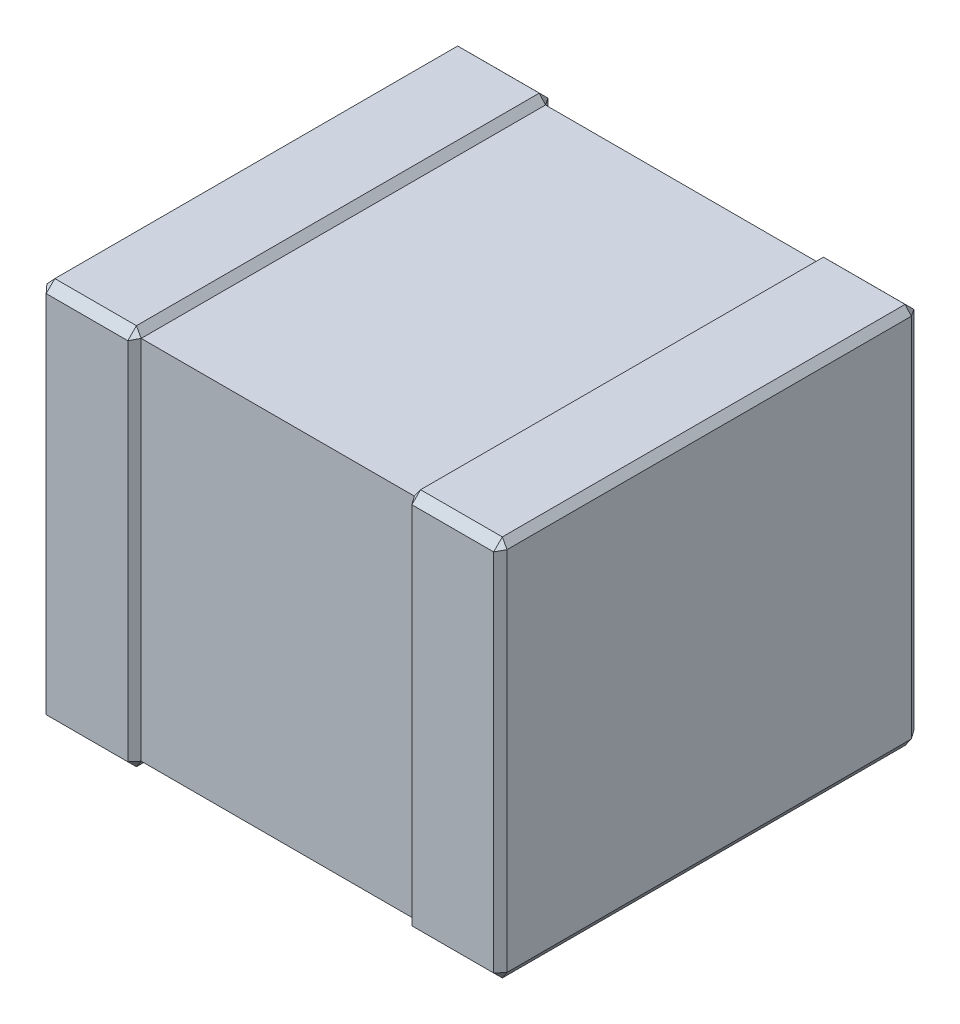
ISO-10303-21;
HEADER;
FILE_DESCRIPTION(('STEP AP214'),'2;1');
FILE_NAME('part.step','',(''),(''),'','','');
FILE_SCHEMA(('AUTOMOTIVE_DESIGN { 1 0 10303 214 1 1 1 1 }'));
ENDSEC;
DATA;
#1=APPLICATION_CONTEXT('core data for automotive mechanical design processes');
#2=APPLICATION_PROTOCOL_DEFINITION('international standard','automotive_design',2000,#1);
#3=PRODUCT_CONTEXT('',#1,'mechanical');
#4=PRODUCT('Part','Part','',(#3));
#5=PRODUCT_RELATED_PRODUCT_CATEGORY('part','',(#4));
#6=PRODUCT_DEFINITION_FORMATION('','',#4);
#7=PRODUCT_DEFINITION_CONTEXT('part definition',#1,'design');
#8=PRODUCT_DEFINITION('design','',#6,#7);
#9=PRODUCT_DEFINITION_SHAPE('','',#8);
#10=(LENGTH_UNIT() NAMED_UNIT(*) SI_UNIT(.MILLI.,.METRE.));
#11=(NAMED_UNIT(*) PLANE_ANGLE_UNIT() SI_UNIT($,.RADIAN.));
#12=(NAMED_UNIT(*) SI_UNIT($,.STERADIAN.) SOLID_ANGLE_UNIT());
#13=UNCERTAINTY_MEASURE_WITH_UNIT(LENGTH_MEASURE(1.E-05),#10,'distance_accuracy_value','');
#14=(GEOMETRIC_REPRESENTATION_CONTEXT(3) GLOBAL_UNCERTAINTY_ASSIGNED_CONTEXT((#13)) GLOBAL_UNIT_ASSIGNED_CONTEXT((#10,
#11,#12)) REPRESENTATION_CONTEXT('',''));
#15=CARTESIAN_POINT('',(0.,0.,0.));
#16=DIRECTION('',(0.,0.,1.));
#17=DIRECTION('',(1.,0.,0.));
#18=AXIS2_PLACEMENT_3D('',#15,#16,#17);
#19=CARTESIAN_POINT('',(1.530112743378,1.210036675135,2.786660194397));
#20=DIRECTION('',(-1.,0.,0.));
#21=DIRECTION('',(0.,0.,1.));
#22=AXIS2_PLACEMENT_3D('',#19,#20,#21);
#23=PLANE('',#22);
#24=CARTESIAN_POINT('',(1.53011274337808,1.23416797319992,0.0879480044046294));
#25=DIRECTION('',(0.,-1.,0.));
#26=VECTOR('',#25,1.);
#27=LINE('',#24,#26);
#28=CARTESIAN_POINT('',(1.53011274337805,1.22210232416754,0.100069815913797));
#29=VERTEX_POINT('',#28);
#30=CARTESIAN_POINT('',(1.53011274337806,-1.22210232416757,0.100069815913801));
#31=VERTEX_POINT('',#30);
#32=EDGE_CURVE('E204',#29,#31,#27,.T.);
#33=ORIENTED_EDGE('',*,*,#32,.F.);
#34=CARTESIAN_POINT('',(1.5301127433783,1.23416797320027,2.81090386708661));
#35=DIRECTION('',(0.,0.,-1.));
#36=VECTOR('',#35,1.);
#37=LINE('',#34,#36);
#38=CARTESIAN_POINT('',(1.530112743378,1.2221023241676,2.79878203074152));
#39=VERTEX_POINT('',#38);
#40=EDGE_CURVE('E212',#39,#29,#37,.T.);
#41=ORIENTED_EDGE('',*,*,#40,.F.);
#42=CARTESIAN_POINT('',(1.53011274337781,-1.2341679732,2.81090386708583));
#43=DIRECTION('',(0.,1.,0.));
#44=VECTOR('',#43,1.);
#45=LINE('',#42,#44);
#46=CARTESIAN_POINT('',(1.530112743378,-1.22210232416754,2.79878203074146));
#47=VERTEX_POINT('',#46);
#48=EDGE_CURVE('E217',#47,#39,#45,.T.);
#49=ORIENTED_EDGE('',*,*,#48,.F.);
#50=CARTESIAN_POINT('',(1.5301127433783,-1.23416797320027,0.0879480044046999));
#51=DIRECTION('',(0.,0.,1.));
#52=VECTOR('',#51,1.);
#53=LINE('',#50,#52);
#54=EDGE_CURVE('E182',#31,#47,#53,.T.);
#55=ORIENTED_EDGE('',*,*,#54,.F.);
#56=EDGE_LOOP('',(#33,#41,#49,#55));
#57=FACE_BOUND('',#56,.T.);
#58=ADVANCED_FACE('F17',(#57),#23,.F.);
#59=CARTESIAN_POINT('',(1.502857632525,-1.264651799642,1.467872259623));
#60=DIRECTION('',(-0.745482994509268,0.66652464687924,0.));
#61=DIRECTION('',(-0.66652464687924,-0.745482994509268,0.));
#62=AXIS2_PLACEMENT_3D('',#59,#60,#61);
#63=PLANE('',#62);
#64=DIRECTION('',(0.,0.,1.));
#65=VECTOR('',#64,1.);
#66=CARTESIAN_POINT('',(1.493605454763,-1.275000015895,0.104939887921));
#67=LINE('',#66,#65);
#68=CARTESIAN_POINT('',(1.49360545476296,-1.27500001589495,2.79391193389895));
#69=VERTEX_POINT('',#68);
#70=CARTESIAN_POINT('',(1.49360545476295,-1.27500001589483,0.104939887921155));
#71=VERTEX_POINT('',#70);
#72=EDGE_CURVE('E186',#69,#71,#67,.F.);
#73=ORIENTED_EDGE('',*,*,#72,.T.);
#74=DIRECTION('',(0.636595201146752,0.712008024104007,-0.296295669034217));
#75=VECTOR('',#74,1.);
#76=CARTESIAN_POINT('',(1.49360545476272,-1.27500001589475,0.104939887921));
#77=LINE('',#76,#75);
#78=EDGE_CURVE('E177',#71,#31,#77,.T.);
#79=ORIENTED_EDGE('',*,*,#78,.T.);
#80=ORIENTED_EDGE('',*,*,#54,.T.);
#81=DIRECTION('',(-0.636595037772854,-0.712007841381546,-0.296296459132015));
#82=VECTOR('',#81,1.);
#83=CARTESIAN_POINT('',(1.530112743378,-1.2341679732,2.810903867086));
#84=LINE('',#83,#82);
#85=EDGE_CURVE('E211',#47,#69,#84,.T.);
#86=ORIENTED_EDGE('',*,*,#85,.T.);
#87=EDGE_LOOP('',(#73,#79,#80,#86));
#88=FACE_BOUND('',#87,.T.);
#89=ADVANCED_FACE('F179',(#88),#63,.F.);
#90=CARTESIAN_POINT('',(1.5028707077,0.01843952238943,2.841514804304));
#91=DIRECTION('',(0.747017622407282,0.,0.664804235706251));
#92=DIRECTION('',(0.664804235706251,0.,-0.747017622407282));
#93=AXIS2_PLACEMENT_3D('',#90,#91,#92);
#94=PLANE('',#93);
#95=DIRECTION('',(0.,1.,0.));
#96=VECTOR('',#95,1.);
#97=CARTESIAN_POINT('',(1.493605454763,1.217254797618,2.851925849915));
#98=LINE('',#97,#96);
#99=CARTESIAN_POINT('',(1.49360545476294,1.21725479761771,2.85192584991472));
#100=VERTEX_POINT('',#99);
#101=CARTESIAN_POINT('',(1.49360545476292,-1.21725479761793,2.85192584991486));
#102=VERTEX_POINT('',#101);
#103=EDGE_CURVE('E560',#100,#102,#98,.F.);
#104=ORIENTED_EDGE('',*,*,#103,.T.);
#105=DIRECTION('',(0.635352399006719,-0.29434743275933,-0.713923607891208));
#106=VECTOR('',#105,1.);
#107=CARTESIAN_POINT('',(1.49360545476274,-1.217254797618,2.85192584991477));
#108=LINE('',#107,#106);
#109=EDGE_CURVE('E218',#102,#47,#108,.T.);
#110=ORIENTED_EDGE('',*,*,#109,.T.);
#111=ORIENTED_EDGE('',*,*,#48,.T.);
#112=DIRECTION('',(-0.635352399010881,-0.294347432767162,0.713923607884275));
#113=VECTOR('',#112,1.);
#114=CARTESIAN_POINT('',(1.530112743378,1.2341679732,2.810903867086));
#115=LINE('',#114,#113);
#116=EDGE_CURVE('E543',#39,#100,#115,.T.);
#117=ORIENTED_EDGE('',*,*,#116,.T.);
#118=EDGE_LOOP('',(#104,#110,#111,#117));
#119=FACE_BOUND('',#118,.T.);
#120=ADVANCED_FACE('F239',(#119),#94,.T.);
#121=CARTESIAN_POINT('',(1.530112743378,-1.2341679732,2.810903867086));
#122=DIRECTION('',(-0.421163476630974,0.64282198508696,-0.63984468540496));
#123=DIRECTION('',(0.,0.705463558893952,0.708746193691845));
#124=AXIS2_PLACEMENT_3D('',#121,#122,#123);
#125=PLANE('',#124);
#126=DIRECTION('',(0.,-0.705463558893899,-0.708746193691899));
#127=VECTOR('',#126,1.);
#128=CARTESIAN_POINT('',(1.493605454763,-1.232767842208,2.836340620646));
#129=LINE('',#128,#127);
#130=EDGE_CURVE('E569',#69,#102,#129,.F.);
#131=ORIENTED_EDGE('',*,*,#130,.F.);
#132=ORIENTED_EDGE('',*,*,#85,.F.);
#133=ORIENTED_EDGE('',*,*,#109,.F.);
#134=EDGE_LOOP('',(#131,#132,#133));
#135=FACE_BOUND('',#134,.T.);
#136=ADVANCED_FACE('F243',(#135),#125,.F.);
#137=CARTESIAN_POINT('',(1.504261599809,1.242628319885,0.07943174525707));
#138=DIRECTION('',(0.421164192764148,0.642821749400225,-0.639844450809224));
#139=DIRECTION('',(0.,0.705463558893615,0.708746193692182));
#140=AXIS2_PLACEMENT_3D('',#137,#138,#139);
#141=PLANE('',#140);
#142=DIRECTION('',(0.,-0.705463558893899,-0.708746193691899));
#143=VECTOR('',#142,1.);
#144=CARTESIAN_POINT('',(1.493605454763,1.275000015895,0.104939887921));
#145=LINE('',#144,#143);
#146=CARTESIAN_POINT('',(1.49360545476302,1.21725479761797,0.0469259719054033));
#147=VERTEX_POINT('',#146);
#148=CARTESIAN_POINT('',(1.49360545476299,1.27500001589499,0.104939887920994));
#149=VERTEX_POINT('',#148);
#150=EDGE_CURVE('E574',#147,#149,#145,.F.);
#151=ORIENTED_EDGE('',*,*,#150,.T.);
#152=DIRECTION('',(0.636595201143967,-0.712008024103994,-0.29629566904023));
#153=VECTOR('',#152,1.);
#154=CARTESIAN_POINT('',(1.49360545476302,1.27500001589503,0.104939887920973));
#155=LINE('',#154,#153);
#156=EDGE_CURVE('E538',#149,#29,#155,.T.);
#157=ORIENTED_EDGE('',*,*,#156,.T.);
#158=DIRECTION('',(0.635352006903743,0.294347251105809,0.713924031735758));
#159=VECTOR('',#158,1.);
#160=CARTESIAN_POINT('',(1.49360545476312,1.217254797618,0.0469259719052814));
#161=LINE('',#160,#159);
#162=EDGE_CURVE('E199',#147,#29,#161,.T.);
#163=ORIENTED_EDGE('',*,*,#162,.F.);
#164=EDGE_LOOP('',(#151,#157,#163));
#165=FACE_BOUND('',#164,.T.);
#166=ADVANCED_FACE('F270',(#165),#141,.T.);
#167=CARTESIAN_POINT('',(1.502857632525,1.264651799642,1.467872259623));
#168=DIRECTION('',(0.745482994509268,0.66652464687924,0.));
#169=DIRECTION('',(-0.66652464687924,0.745482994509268,0.));
#170=AXIS2_PLACEMENT_3D('',#167,#168,#169);
#171=PLANE('',#170);
#172=DIRECTION('',(0.,0.,-1.));
#173=VECTOR('',#172,1.);
#174=CARTESIAN_POINT('',(1.493605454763,1.275000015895,0.104939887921));
#175=LINE('',#174,#173);
#176=CARTESIAN_POINT('',(1.49360545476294,1.27500001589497,2.79391193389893));
#177=VERTEX_POINT('',#176);
#178=EDGE_CURVE('E581',#149,#177,#175,.F.);
#179=ORIENTED_EDGE('',*,*,#178,.T.);
#180=DIRECTION('',(0.636595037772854,-0.712007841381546,0.296296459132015));
#181=VECTOR('',#180,1.);
#182=CARTESIAN_POINT('',(1.49360545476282,1.27500001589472,2.79391193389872));
#183=LINE('',#182,#181);
#184=EDGE_CURVE('E200',#177,#39,#183,.T.);
#185=ORIENTED_EDGE('',*,*,#184,.T.);
#186=ORIENTED_EDGE('',*,*,#40,.T.);
#187=ORIENTED_EDGE('',*,*,#156,.F.);
#188=EDGE_LOOP('',(#179,#185,#186,#187));
#189=FACE_BOUND('',#188,.T.);
#190=ADVANCED_FACE('F260',(#189),#171,.T.);
#191=CARTESIAN_POINT('',(1.530112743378,1.2341679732,2.810903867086));
#192=DIRECTION('',(-0.421163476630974,-0.64282198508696,-0.63984468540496));
#193=DIRECTION('',(0.,0.705463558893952,-0.708746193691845));
#194=AXIS2_PLACEMENT_3D('',#191,#192,#193);
#195=PLANE('',#194);
#196=DIRECTION('',(0.,0.705463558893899,-0.708746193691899));
#197=VECTOR('',#196,1.);
#198=CARTESIAN_POINT('',(1.493605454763,1.275000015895,2.793911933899));
#199=LINE('',#198,#197);
#200=EDGE_CURVE('E584',#177,#100,#199,.F.);
#201=ORIENTED_EDGE('',*,*,#200,.T.);
#202=ORIENTED_EDGE('',*,*,#116,.F.);
#203=ORIENTED_EDGE('',*,*,#184,.F.);
#204=EDGE_LOOP('',(#201,#202,#203));
#205=FACE_BOUND('',#204,.T.);
#206=ADVANCED_FACE('F269',(#205),#195,.F.);
#207=CARTESIAN_POINT('',(1.504261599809,-1.242628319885,0.07943174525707));
#208=DIRECTION('',(0.421164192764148,-0.642821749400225,-0.639844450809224));
#209=DIRECTION('',(0.,0.705463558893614,-0.708746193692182));
#210=AXIS2_PLACEMENT_3D('',#207,#208,#209);
#211=PLANE('',#210);
#212=DIRECTION('',(0.,0.705463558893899,-0.708746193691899));
#213=VECTOR('',#212,1.);
#214=CARTESIAN_POINT('',(1.493605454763,-1.232767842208,0.06251120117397));
#215=LINE('',#214,#213);
#216=CARTESIAN_POINT('',(1.49360545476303,-1.21725479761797,0.0469259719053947));
#217=VERTEX_POINT('',#216);
#218=EDGE_CURVE('E195',#217,#71,#215,.F.);
#219=ORIENTED_EDGE('',*,*,#218,.F.);
#220=DIRECTION('',(0.635352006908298,-0.294347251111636,0.713924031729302));
#221=VECTOR('',#220,1.);
#222=CARTESIAN_POINT('',(1.49360545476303,-1.21725479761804,0.0469259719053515));
#223=LINE('',#222,#221);
#224=EDGE_CURVE('E192',#217,#31,#223,.T.);
#225=ORIENTED_EDGE('',*,*,#224,.T.);
#226=ORIENTED_EDGE('',*,*,#78,.F.);
#227=EDGE_LOOP('',(#219,#225,#226));
#228=FACE_BOUND('',#227,.T.);
#229=ADVANCED_FACE('F194',(#228),#211,.T.);
#230=CARTESIAN_POINT('',(1.502870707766,0.01843953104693,0.05733703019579));
#231=DIRECTION('',(0.747018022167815,0.,-0.664803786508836));
#232=DIRECTION('',(-0.664803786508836,0.,-0.747018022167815));
#233=AXIS2_PLACEMENT_3D('',#230,#231,#232);
#234=PLANE('',#233);
#235=DIRECTION('',(0.,1.,0.));
#236=VECTOR('',#235,1.);
#237=CARTESIAN_POINT('',(1.493605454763,-1.217254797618,0.04692597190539));
#238=LINE('',#237,#236);
#239=EDGE_CURVE('E603',#217,#147,#238,.T.);
#240=ORIENTED_EDGE('',*,*,#239,.T.);
#241=ORIENTED_EDGE('',*,*,#162,.T.);
#242=ORIENTED_EDGE('',*,*,#32,.T.);
#243=ORIENTED_EDGE('',*,*,#224,.F.);
#244=EDGE_LOOP('',(#240,#241,#242,#243));
#245=FACE_BOUND('',#244,.T.);
#246=ADVANCED_FACE('F206',(#245),#234,.T.);
#247=CARTESIAN_POINT('',(1.201830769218,1.232767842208,2.836340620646));
#248=DIRECTION('',(0.,-0.708746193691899,-0.705463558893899));
#249=DIRECTION('',(0.,0.705463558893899,-0.708746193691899));
#250=AXIS2_PLACEMENT_3D('',#247,#248,#249);
#251=PLANE('',#250);
#252=DIRECTION('',(1.,0.,0.));
#253=VECTOR('',#252,1.);
#254=CARTESIAN_POINT('',(1.201830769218,1.21725479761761,2.85192584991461));
#255=LINE('',#254,#253);
#256=CARTESIAN_POINT('',(0.94793065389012,1.2172547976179,2.85192584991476));
#257=VERTEX_POINT('',#256);
#258=EDGE_CURVE('E593',#100,#257,#255,.F.);
#259=ORIENTED_EDGE('',*,*,#258,.F.);
#260=ORIENTED_EDGE('',*,*,#200,.F.);
#261=DIRECTION('',(1.,0.,0.));
#262=VECTOR('',#261,1.);
#263=CARTESIAN_POINT('',(0.94793065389,1.275000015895,2.793911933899));
#264=LINE('',#263,#262);
#265=CARTESIAN_POINT('',(0.947930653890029,1.27500001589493,2.79391193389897));
#266=VERTEX_POINT('',#265);
#267=EDGE_CURVE('E613',#177,#266,#264,.F.);
#268=ORIENTED_EDGE('',*,*,#267,.T.);
#269=DIRECTION('',(0.,0.705463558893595,-0.708746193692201));
#270=VECTOR('',#269,1.);
#271=CARTESIAN_POINT('',(0.947930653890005,1.24613537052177,2.82291089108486));
#272=LINE('',#271,#270);
#273=EDGE_CURVE('E618',#266,#257,#272,.F.);
#274=ORIENTED_EDGE('',*,*,#273,.T.);
#275=EDGE_LOOP('',(#259,#260,#268,#274));
#276=FACE_BOUND('',#275,.T.);
#277=ADVANCED_FACE('F754',(#276),#251,.F.);
#278=CARTESIAN_POINT('',(1.493605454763,-1.275000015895,0.104939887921));
#279=DIRECTION('',(0.,1.,0.));
#280=DIRECTION('',(0.,0.,1.));
#281=AXIS2_PLACEMENT_3D('',#278,#279,#280);
#282=PLANE('',#281);
#283=DIRECTION('',(0.,0.,1.));
#284=VECTOR('',#283,1.);
#285=CARTESIAN_POINT('',(0.947930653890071,-1.27500001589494,1.467872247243));
#286=LINE('',#285,#284);
#287=CARTESIAN_POINT('',(0.947930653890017,-1.27500001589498,2.793911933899));
#288=VERTEX_POINT('',#287);
#289=CARTESIAN_POINT('',(0.947930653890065,-1.27500001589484,0.104939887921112));
#290=VERTEX_POINT('',#289);
#291=EDGE_CURVE('E632',#288,#290,#286,.F.);
#292=ORIENTED_EDGE('',*,*,#291,.T.);
#293=DIRECTION('',(1.,0.,0.));
#294=VECTOR('',#293,1.);
#295=CARTESIAN_POINT('',(1.201830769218,-1.27500001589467,0.10493988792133));
#296=LINE('',#295,#294);
#297=EDGE_CURVE('E623',#71,#290,#296,.F.);
#298=ORIENTED_EDGE('',*,*,#297,.F.);
#299=ORIENTED_EDGE('',*,*,#72,.F.);
#300=DIRECTION('',(1.,0.,0.));
#301=VECTOR('',#300,1.);
#302=CARTESIAN_POINT('',(1.493605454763,-1.275000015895,2.793911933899));
#303=LINE('',#302,#301);
#304=EDGE_CURVE('E556',#288,#69,#303,.T.);
#305=ORIENTED_EDGE('',*,*,#304,.F.);
#306=EDGE_LOOP('',(#292,#298,#299,#305));
#307=FACE_BOUND('',#306,.T.);
#308=ADVANCED_FACE('F750',(#307),#282,.F.);
#309=CARTESIAN_POINT('',(0.94793065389,1.217254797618,2.851925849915));
#310=DIRECTION('',(0.,0.,-1.));
#311=DIRECTION('',(-1.,0.,0.));
#312=AXIS2_PLACEMENT_3D('',#309,#310,#311);
#313=PLANE('',#312);
#314=DIRECTION('',(-1.,0.,0.));
#315=VECTOR('',#314,1.);
#316=CARTESIAN_POINT('',(0.94793065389,-1.217254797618,2.851925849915));
#317=LINE('',#316,#315);
#318=CARTESIAN_POINT('',(0.947930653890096,-1.21725479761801,2.85192584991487));
#319=VERTEX_POINT('',#318);
#320=EDGE_CURVE('E605',#102,#319,#317,.T.);
#321=ORIENTED_EDGE('',*,*,#320,.F.);
#322=ORIENTED_EDGE('',*,*,#103,.F.);
#323=ORIENTED_EDGE('',*,*,#258,.T.);
#324=DIRECTION('',(0.,1.,0.));
#325=VECTOR('',#324,1.);
#326=CARTESIAN_POINT('',(0.947930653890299,0.01843951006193,2.85192584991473));
#327=LINE('',#326,#325);
#328=EDGE_CURVE('E637',#319,#257,#327,.T.);
#329=ORIENTED_EDGE('',*,*,#328,.F.);
#330=EDGE_LOOP('',(#321,#322,#323,#329));
#331=FACE_BOUND('',#330,.T.);
#332=ADVANCED_FACE('F746',(#331),#313,.F.);
#333=CARTESIAN_POINT('',(0.94793065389,-1.217254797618,2.851925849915));
#334=DIRECTION('',(0.,0.708746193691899,-0.705463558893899));
#335=DIRECTION('',(0.,0.705463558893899,0.708746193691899));
#336=AXIS2_PLACEMENT_3D('',#333,#334,#335);
#337=PLANE('',#336);
#338=ORIENTED_EDGE('',*,*,#304,.T.);
#339=ORIENTED_EDGE('',*,*,#130,.T.);
#340=ORIENTED_EDGE('',*,*,#320,.T.);
#341=DIRECTION('',(0.,-0.705463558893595,-0.708746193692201));
#342=VECTOR('',#341,1.);
#343=CARTESIAN_POINT('',(0.947930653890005,-1.24613537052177,2.82291089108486));
#344=LINE('',#343,#342);
#345=EDGE_CURVE('E649',#288,#319,#344,.F.);
#346=ORIENTED_EDGE('',*,*,#345,.F.);
#347=EDGE_LOOP('',(#338,#339,#340,#346));
#348=FACE_BOUND('',#347,.T.);
#349=ADVANCED_FACE('F742',(#348),#337,.F.);
#350=CARTESIAN_POINT('',(1.201830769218,1.232767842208,0.06251120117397));
#351=DIRECTION('',(0.,0.708746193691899,-0.705463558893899));
#352=DIRECTION('',(0.,0.705463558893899,0.708746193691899));
#353=AXIS2_PLACEMENT_3D('',#350,#351,#352);
#354=PLANE('',#353);
#355=DIRECTION('',(1.,0.,0.));
#356=VECTOR('',#355,1.);
#357=CARTESIAN_POINT('',(0.94793065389,1.217254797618,0.04692597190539));
#358=LINE('',#357,#356);
#359=CARTESIAN_POINT('',(0.947930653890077,1.2172547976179,0.0469259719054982));
#360=VERTEX_POINT('',#359);
#361=EDGE_CURVE('E627',#147,#360,#358,.F.);
#362=ORIENTED_EDGE('',*,*,#361,.T.);
#363=DIRECTION('',(0.,-0.705463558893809,-0.708746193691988));
#364=VECTOR('',#363,1.);
#365=CARTESIAN_POINT('',(0.947930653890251,1.24618292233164,0.0759887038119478));
#366=LINE('',#365,#364);
#367=CARTESIAN_POINT('',(0.947930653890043,1.27500001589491,0.104939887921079));
#368=VERTEX_POINT('',#367);
#369=EDGE_CURVE('E652',#360,#368,#366,.F.);
#370=ORIENTED_EDGE('',*,*,#369,.T.);
#371=DIRECTION('',(1.,0.,0.));
#372=VECTOR('',#371,1.);
#373=CARTESIAN_POINT('',(0.94793065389,1.275000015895,0.104939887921));
#374=LINE('',#373,#372);
#375=EDGE_CURVE('E578',#368,#149,#374,.T.);
#376=ORIENTED_EDGE('',*,*,#375,.T.);
#377=ORIENTED_EDGE('',*,*,#150,.F.);
#378=EDGE_LOOP('',(#362,#370,#376,#377));
#379=FACE_BOUND('',#378,.T.);
#380=ADVANCED_FACE('F738',(#379),#354,.T.);
#381=CARTESIAN_POINT('',(0.94793065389,1.275000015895,0.104939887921));
#382=DIRECTION('',(0.,-1.,0.));
#383=DIRECTION('',(0.,0.,-1.));
#384=AXIS2_PLACEMENT_3D('',#381,#382,#383);
#385=PLANE('',#384);
#386=ORIENTED_EDGE('',*,*,#267,.F.);
#387=ORIENTED_EDGE('',*,*,#178,.F.);
#388=ORIENTED_EDGE('',*,*,#375,.F.);
#389=DIRECTION('',(0.,0.,1.));
#390=VECTOR('',#389,1.);
#391=CARTESIAN_POINT('',(0.947930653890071,1.27500001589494,1.467872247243));
#392=LINE('',#391,#390);
#393=EDGE_CURVE('E661',#368,#266,#392,.T.);
#394=ORIENTED_EDGE('',*,*,#393,.T.);
#395=EDGE_LOOP('',(#386,#387,#388,#394));
#396=FACE_BOUND('',#395,.T.);
#397=ADVANCED_FACE('F734',(#396),#385,.F.);
#398=CARTESIAN_POINT('',(0.937274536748,1.242628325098,2.819420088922));
#399=DIRECTION('',(0.421164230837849,-0.642821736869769,-0.63984443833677));
#400=DIRECTION('',(0.,0.705463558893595,-0.708746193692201));
#401=AXIS2_PLACEMENT_3D('',#398,#399,#400);
#402=PLANE('',#401);
#403=ORIENTED_EDGE('',*,*,#273,.F.);
#404=DIRECTION('',(-0.636594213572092,-0.712008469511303,0.296296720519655));
#405=VECTOR('',#404,1.);
#406=CARTESIAN_POINT('',(0.947930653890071,1.27500001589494,2.793911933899));
#407=LINE('',#406,#405);
#408=CARTESIAN_POINT('',(0.911423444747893,1.22210232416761,2.79878203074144));
#409=VERTEX_POINT('',#408);
#410=EDGE_CURVE('E666',#266,#409,#407,.T.);
#411=ORIENTED_EDGE('',*,*,#410,.T.);
#412=DIRECTION('',(-0.635351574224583,0.294347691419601,-0.713924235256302));
#413=VECTOR('',#412,1.);
#414=CARTESIAN_POINT('',(0.947930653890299,1.217254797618,2.85192584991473));
#415=LINE('',#414,#413);
#416=EDGE_CURVE('E642',#257,#409,#415,.T.);
#417=ORIENTED_EDGE('',*,*,#416,.F.);
#418=EDGE_LOOP('',(#403,#411,#417));
#419=FACE_BOUND('',#418,.T.);
#420=ADVANCED_FACE('F730',(#419),#402,.F.);
#421=CARTESIAN_POINT('',(1.201830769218,-1.259486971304,0.08935465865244));
#422=DIRECTION('',(0.,-0.708746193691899,-0.705463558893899));
#423=DIRECTION('',(0.,0.705463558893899,-0.708746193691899));
#424=AXIS2_PLACEMENT_3D('',#421,#422,#423);
#425=PLANE('',#424);
#426=ORIENTED_EDGE('',*,*,#297,.T.);
#427=DIRECTION('',(0.,-0.705463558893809,0.708746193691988));
#428=VECTOR('',#427,1.);
#429=CARTESIAN_POINT('',(0.947930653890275,-1.24613537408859,0.0759409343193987));
#430=LINE('',#429,#428);
#431=CARTESIAN_POINT('',(0.947930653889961,-1.21725479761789,0.0469259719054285));
#432=VERTEX_POINT('',#431);
#433=EDGE_CURVE('E671',#290,#432,#430,.F.);
#434=ORIENTED_EDGE('',*,*,#433,.T.);
#435=DIRECTION('',(1.,0.,0.));
#436=VECTOR('',#435,1.);
#437=CARTESIAN_POINT('',(0.94793065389,-1.217254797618,0.04692597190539));
#438=LINE('',#437,#436);
#439=EDGE_CURVE('E600',#432,#217,#438,.T.);
#440=ORIENTED_EDGE('',*,*,#439,.T.);
#441=ORIENTED_EDGE('',*,*,#218,.T.);
#442=EDGE_LOOP('',(#426,#434,#440,#441));
#443=FACE_BOUND('',#442,.T.);
#444=ADVANCED_FACE('F726',(#443),#425,.T.);
#445=CARTESIAN_POINT('',(0.94793065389,-1.217254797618,0.04692597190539));
#446=DIRECTION('',(0.,0.,1.));
#447=DIRECTION('',(1.,0.,0.));
#448=AXIS2_PLACEMENT_3D('',#445,#446,#447);
#449=PLANE('',#448);
#450=ORIENTED_EDGE('',*,*,#361,.F.);
#451=ORIENTED_EDGE('',*,*,#239,.F.);
#452=ORIENTED_EDGE('',*,*,#439,.F.);
#453=DIRECTION('',(0.,1.,0.));
#454=VECTOR('',#453,1.);
#455=CARTESIAN_POINT('',(0.947930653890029,1.2341679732,0.0469259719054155));
#456=LINE('',#455,#454);
#457=EDGE_CURVE('E676',#432,#360,#456,.T.);
#458=ORIENTED_EDGE('',*,*,#457,.T.);
#459=EDGE_LOOP('',(#450,#451,#452,#458));
#460=FACE_BOUND('',#459,.T.);
#461=ADVANCED_FACE('F722',(#460),#449,.F.);
#462=CARTESIAN_POINT('',(0.937274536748,-1.242628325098,2.819420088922));
#463=DIRECTION('',(-0.421164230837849,-0.642821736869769,0.63984443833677));
#464=DIRECTION('',(0.,-0.705463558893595,-0.708746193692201));
#465=AXIS2_PLACEMENT_3D('',#462,#463,#464);
#466=PLANE('',#465);
#467=ORIENTED_EDGE('',*,*,#345,.T.);
#468=DIRECTION('',(-0.635351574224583,-0.294347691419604,-0.7139242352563));
#469=VECTOR('',#468,1.);
#470=CARTESIAN_POINT('',(0.947930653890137,-1.217254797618,2.85192584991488));
#471=LINE('',#470,#469);
#472=CARTESIAN_POINT('',(0.911423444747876,-1.22210232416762,2.79878203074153));
#473=VERTEX_POINT('',#472);
#474=EDGE_CURVE('E691',#319,#473,#471,.T.);
#475=ORIENTED_EDGE('',*,*,#474,.T.);
#476=DIRECTION('',(0.636594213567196,-0.712008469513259,-0.296296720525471));
#477=VECTOR('',#476,1.);
#478=CARTESIAN_POINT('',(0.911423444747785,-1.23416797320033,2.81090386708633));
#479=LINE('',#478,#477);
#480=EDGE_CURVE('E646',#473,#288,#479,.T.);
#481=ORIENTED_EDGE('',*,*,#480,.T.);
#482=EDGE_LOOP('',(#467,#475,#481));
#483=FACE_BOUND('',#482,.T.);
#484=ADVANCED_FACE('F718',(#483),#466,.T.);
#485=CARTESIAN_POINT('',(0.911423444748,1.2341679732,0.0879480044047));
#486=DIRECTION('',(0.42116494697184,-0.642821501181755,0.639844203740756));
#487=DIRECTION('',(0.,-0.705463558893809,-0.708746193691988));
#488=AXIS2_PLACEMENT_3D('',#485,#486,#487);
#489=PLANE('',#488);
#490=ORIENTED_EDGE('',*,*,#369,.F.);
#491=DIRECTION('',(-0.63535118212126,0.294347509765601,0.713924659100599));
#492=VECTOR('',#491,1.);
#493=CARTESIAN_POINT('',(0.947930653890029,1.217254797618,0.0469259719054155));
#494=LINE('',#493,#492);
#495=CARTESIAN_POINT('',(0.911423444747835,1.22210232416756,0.100069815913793));
#496=VERTEX_POINT('',#495);
#497=EDGE_CURVE('E681',#360,#496,#494,.T.);
#498=ORIENTED_EDGE('',*,*,#497,.T.);
#499=DIRECTION('',(0.636594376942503,0.712008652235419,0.296295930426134));
#500=VECTOR('',#499,1.);
#501=CARTESIAN_POINT('',(0.91142344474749,1.23416797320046,0.0879480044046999));
#502=LINE('',#501,#500);
#503=EDGE_CURVE('E784',#496,#368,#502,.T.);
#504=ORIENTED_EDGE('',*,*,#503,.T.);
#505=EDGE_LOOP('',(#490,#498,#504));
#506=FACE_BOUND('',#505,.T.);
#507=ADVANCED_FACE('F714',(#506),#489,.F.);
#508=CARTESIAN_POINT('',(0.937274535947,-1.242628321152,0.07943174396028));
#509=DIRECTION('',(0.42116494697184,0.642821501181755,0.639844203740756));
#510=DIRECTION('',(0.,-0.705463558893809,0.708746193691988));
#511=AXIS2_PLACEMENT_3D('',#508,#509,#510);
#512=PLANE('',#511);
#513=ORIENTED_EDGE('',*,*,#433,.F.);
#514=DIRECTION('',(-0.636594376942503,0.712008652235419,-0.296295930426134));
#515=VECTOR('',#514,1.);
#516=CARTESIAN_POINT('',(0.94793065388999,-1.27500001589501,0.104939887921));
#517=LINE('',#516,#515);
#518=CARTESIAN_POINT('',(0.911423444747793,-1.22210232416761,0.100069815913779));
#519=VERTEX_POINT('',#518);
#520=EDGE_CURVE('E686',#290,#519,#517,.T.);
#521=ORIENTED_EDGE('',*,*,#520,.T.);
#522=DIRECTION('',(0.63535118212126,0.294347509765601,-0.713924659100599));
#523=VECTOR('',#522,1.);
#524=CARTESIAN_POINT('',(0.911423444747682,-1.2341679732,0.0879480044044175));
#525=LINE('',#524,#523);
#526=EDGE_CURVE('E787',#519,#432,#525,.T.);
#527=ORIENTED_EDGE('',*,*,#526,.T.);
#528=EDGE_LOOP('',(#513,#521,#527));
#529=FACE_BOUND('',#528,.T.);
#530=ADVANCED_FACE('F709',(#529),#512,.F.);
#531=CARTESIAN_POINT('',(0.920618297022,-1.244452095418,1.439475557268));
#532=DIRECTION('',(0.745483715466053,0.666523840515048,0.));
#533=DIRECTION('',(-0.666523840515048,0.745483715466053,0.));
#534=AXIS2_PLACEMENT_3D('',#531,#532,#533);
#535=PLANE('',#534);
#536=ORIENTED_EDGE('',*,*,#520,.F.);
#537=ORIENTED_EDGE('',*,*,#291,.F.);
#538=ORIENTED_EDGE('',*,*,#480,.F.);
#539=CARTESIAN_POINT('',(0.91142344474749,-1.23416797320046,2.810903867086));
#540=DIRECTION('',(0.,0.,-1.));
#541=VECTOR('',#540,1.);
#542=LINE('',#539,#541);
#543=EDGE_CURVE('E828',#473,#519,#542,.T.);
#544=ORIENTED_EDGE('',*,*,#543,.T.);
#545=EDGE_LOOP('',(#536,#537,#538,#544));
#546=FACE_BOUND('',#545,.T.);
#547=ADVANCED_FACE('F698',(#546),#535,.F.);
#548=CARTESIAN_POINT('',(0.911423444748,1.2341679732,2.810903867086));
#549=DIRECTION('',(0.747018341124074,0.,-0.664803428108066));
#550=DIRECTION('',(-0.664803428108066,0.,-0.747018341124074));
#551=AXIS2_PLACEMENT_3D('',#548,#549,#550);
#552=PLANE('',#551);
#553=ORIENTED_EDGE('',*,*,#474,.F.);
#554=ORIENTED_EDGE('',*,*,#328,.T.);
#555=ORIENTED_EDGE('',*,*,#416,.T.);
#556=CARTESIAN_POINT('',(0.911423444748,1.2341679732,2.810903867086));
#557=DIRECTION('',(0.,-1.,0.));
#558=VECTOR('',#557,1.);
#559=LINE('',#556,#558);
#560=EDGE_CURVE('E437',#409,#473,#559,.T.);
#561=ORIENTED_EDGE('',*,*,#560,.T.);
#562=EDGE_LOOP('',(#553,#554,#555,#561));
#563=FACE_BOUND('',#562,.T.);
#564=ADVANCED_FACE('F708',(#563),#552,.F.);
#565=CARTESIAN_POINT('',(0.920618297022,1.244452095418,1.439475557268));
#566=DIRECTION('',(0.745483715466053,-0.666523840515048,0.));
#567=DIRECTION('',(0.666523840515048,0.745483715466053,0.));
#568=AXIS2_PLACEMENT_3D('',#565,#566,#567);
#569=PLANE('',#568);
#570=ORIENTED_EDGE('',*,*,#503,.F.);
#571=CARTESIAN_POINT('',(0.911423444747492,1.23416797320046,0.0879480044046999));
#572=DIRECTION('',(0.,0.,1.));
#573=VECTOR('',#572,1.);
#574=LINE('',#571,#573);
#575=EDGE_CURVE('E451',#496,#409,#574,.T.);
#576=ORIENTED_EDGE('',*,*,#575,.T.);
#577=ORIENTED_EDGE('',*,*,#410,.F.);
#578=ORIENTED_EDGE('',*,*,#393,.F.);
#579=EDGE_LOOP('',(#570,#576,#577,#578));
#580=FACE_BOUND('',#579,.T.);
#581=ADVANCED_FACE('F805',(#580),#569,.F.);
#582=CARTESIAN_POINT('',(0.92062571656,-0.009982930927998,0.07760769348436));
#583=DIRECTION('',(0.747018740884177,0.,0.664802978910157));
#584=DIRECTION('',(0.664802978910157,0.,-0.747018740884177));
#585=AXIS2_PLACEMENT_3D('',#582,#583,#584);
#586=PLANE('',#585);
#587=ORIENTED_EDGE('',*,*,#526,.F.);
#588=CARTESIAN_POINT('',(0.911423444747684,-1.2341679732,0.0879480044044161));
#589=DIRECTION('',(0.,1.,0.));
#590=VECTOR('',#589,1.);
#591=LINE('',#588,#590);
#592=EDGE_CURVE('E400',#519,#496,#591,.T.);
#593=ORIENTED_EDGE('',*,*,#592,.T.);
#594=ORIENTED_EDGE('',*,*,#497,.F.);
#595=ORIENTED_EDGE('',*,*,#457,.F.);
#596=EDGE_LOOP('',(#587,#593,#594,#595));
#597=FACE_BOUND('',#596,.T.);
#598=ADVANCED_FACE('F463',(#597),#586,.F.);
#599=CARTESIAN_POINT('',(0.911423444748,1.210036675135,2.786660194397));
#600=DIRECTION('',(0.,-1.,0.));
#601=DIRECTION('',(0.,0.,-1.));
#602=AXIS2_PLACEMENT_3D('',#599,#600,#601);
#603=PLANE('',#602);
#604=CARTESIAN_POINT('',(-0.89057191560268,1.210036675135,0.100069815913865));
#605=DIRECTION('',(0.,0.,1.));
#606=VECTOR('',#605,1.);
#607=LINE('',#604,#606);
#608=CARTESIAN_POINT('',(-0.912147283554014,1.2221023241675,0.100069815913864));
#609=VERTEX_POINT('',#608);
#610=CARTESIAN_POINT('',(-0.912147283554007,1.22210232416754,2.79878203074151));
#611=VERTEX_POINT('',#610);
#612=EDGE_CURVE('E477',#609,#611,#607,.T.);
#613=ORIENTED_EDGE('',*,*,#612,.T.);
#614=DIRECTION('',(-1.,0.,0.));
#615=VECTOR('',#614,1.);
#616=CARTESIAN_POINT('',(0.911423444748,1.210036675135,2.786660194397));
#617=LINE('',#616,#615);
#618=EDGE_CURVE('E846',#611,#409,#617,.F.);
#619=ORIENTED_EDGE('',*,*,#618,.T.);
#620=ORIENTED_EDGE('',*,*,#575,.F.);
#621=DIRECTION('',(1.,0.,0.));
#622=VECTOR('',#621,1.);
#623=CARTESIAN_POINT('',(0.911423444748,1.210036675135,0.112191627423));
#624=LINE('',#623,#622);
#625=EDGE_CURVE('E852',#496,#609,#624,.F.);
#626=ORIENTED_EDGE('',*,*,#625,.T.);
#627=EDGE_LOOP('',(#613,#619,#620,#626));
#628=FACE_BOUND('',#627,.T.);
#629=ADVANCED_FACE('F454',(#628),#603,.F.);
#630=CARTESIAN_POINT('',(0.911423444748,1.210036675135,2.786660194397));
#631=DIRECTION('',(0.,0.,-1.));
#632=DIRECTION('',(-1.,0.,0.));
#633=AXIS2_PLACEMENT_3D('',#630,#631,#632);
#634=PLANE('',#633);
#635=DIRECTION('',(0.,-1.,0.));
#636=VECTOR('',#635,1.);
#637=CARTESIAN_POINT('',(-0.890571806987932,-0.00998292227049,2.786660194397));
#638=LINE('',#637,#636);
#639=CARTESIAN_POINT('',(-0.912147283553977,-1.22210232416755,2.79878203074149));
#640=VERTEX_POINT('',#639);
#641=EDGE_CURVE('E481',#611,#640,#638,.T.);
#642=ORIENTED_EDGE('',*,*,#641,.T.);
#643=DIRECTION('',(1.,0.,0.));
#644=VECTOR('',#643,1.);
#645=CARTESIAN_POINT('',(0.911423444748,-1.210036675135,2.786660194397));
#646=LINE('',#645,#644);
#647=EDGE_CURVE('E848',#640,#473,#646,.T.);
#648=ORIENTED_EDGE('',*,*,#647,.T.);
#649=ORIENTED_EDGE('',*,*,#560,.F.);
#650=ORIENTED_EDGE('',*,*,#618,.F.);
#651=EDGE_LOOP('',(#642,#648,#649,#650));
#652=FACE_BOUND('',#651,.T.);
#653=ADVANCED_FACE('F420',(#652),#634,.F.);
#654=CARTESIAN_POINT('',(0.911423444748,-1.210036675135,2.786660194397));
#655=DIRECTION('',(0.,1.,0.));
#656=DIRECTION('',(0.,0.,1.));
#657=AXIS2_PLACEMENT_3D('',#654,#655,#656);
#658=PLANE('',#657);
#659=DIRECTION('',(0.,0.,-1.));
#660=VECTOR('',#659,1.);
#661=CARTESIAN_POINT('',(-0.890571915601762,-1.210036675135,1.439475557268));
#662=LINE('',#661,#660);
#663=CARTESIAN_POINT('',(-0.912147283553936,-1.22210232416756,0.10006981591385));
#664=VERTEX_POINT('',#663);
#665=EDGE_CURVE('E484',#640,#664,#662,.T.);
#666=ORIENTED_EDGE('',*,*,#665,.T.);
#667=DIRECTION('',(1.,0.,0.));
#668=VECTOR('',#667,1.);
#669=CARTESIAN_POINT('',(0.911423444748,-1.210036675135,0.112191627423));
#670=LINE('',#669,#668);
#671=EDGE_CURVE('E842',#664,#519,#670,.T.);
#672=ORIENTED_EDGE('',*,*,#671,.T.);
#673=ORIENTED_EDGE('',*,*,#543,.F.);
#674=ORIENTED_EDGE('',*,*,#647,.F.);
#675=EDGE_LOOP('',(#666,#672,#673,#674));
#676=FACE_BOUND('',#675,.T.);
#677=ADVANCED_FACE('F416',(#676),#658,.F.);
#678=CARTESIAN_POINT('',(0.911423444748,1.210036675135,0.112191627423));
#679=DIRECTION('',(0.,0.,1.));
#680=DIRECTION('',(1.,0.,0.));
#681=AXIS2_PLACEMENT_3D('',#678,#679,#680);
#682=PLANE('',#681);
#683=DIRECTION('',(0.,1.,0.));
#684=VECTOR('',#683,1.);
#685=CARTESIAN_POINT('',(-0.890571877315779,1.2341679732,0.112191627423));
#686=LINE('',#685,#684);
#687=EDGE_CURVE('E492',#664,#609,#686,.T.);
#688=ORIENTED_EDGE('',*,*,#687,.T.);
#689=ORIENTED_EDGE('',*,*,#625,.F.);
#690=ORIENTED_EDGE('',*,*,#592,.F.);
#691=ORIENTED_EDGE('',*,*,#671,.F.);
#692=EDGE_LOOP('',(#688,#689,#690,#691));
#693=FACE_BOUND('',#692,.T.);
#694=ADVANCED_FACE('F407',(#693),#682,.F.);
#695=CARTESIAN_POINT('',(-0.937998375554,-1.242628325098,2.819420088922));
#696=DIRECTION('',(-0.421164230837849,0.642821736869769,-0.63984443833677));
#697=DIRECTION('',(0.,0.705463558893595,0.708746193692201));
#698=AXIS2_PLACEMENT_3D('',#695,#696,#697);
#699=PLANE('',#698);
#700=DIRECTION('',(0.,0.705463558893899,0.708746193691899));
#701=VECTOR('',#700,1.);
#702=CARTESIAN_POINT('',(-0.948654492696,-1.275000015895,2.793911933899));
#703=LINE('',#702,#701);
#704=CARTESIAN_POINT('',(-0.94865449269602,-1.21725479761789,2.85192584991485));
#705=VERTEX_POINT('',#704);
#706=CARTESIAN_POINT('',(-0.948654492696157,-1.27500001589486,2.793911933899));
#707=VERTEX_POINT('',#706);
#708=EDGE_CURVE('E882',#705,#707,#703,.F.);
#709=ORIENTED_EDGE('',*,*,#708,.T.);
#710=DIRECTION('',(0.636594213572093,0.712008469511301,0.296296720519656));
#711=VECTOR('',#710,1.);
#712=CARTESIAN_POINT('',(-0.948654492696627,-1.27500001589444,2.793911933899));
#713=LINE('',#712,#711);
#714=EDGE_CURVE('E887',#707,#640,#713,.T.);
#715=ORIENTED_EDGE('',*,*,#714,.T.);
#716=DIRECTION('',(0.635351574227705,-0.294347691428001,-0.71392423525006));
#717=VECTOR('',#716,1.);
#718=CARTESIAN_POINT('',(-0.948654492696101,-1.21725479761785,2.85192584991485));
#719=LINE('',#718,#717);
#720=EDGE_CURVE('E489',#705,#640,#719,.T.);
#721=ORIENTED_EDGE('',*,*,#720,.F.);
#722=EDGE_LOOP('',(#709,#715,#721));
#723=FACE_BOUND('',#722,.T.);
#724=ADVANCED_FACE('F380',(#723),#699,.F.);
#725=CARTESIAN_POINT('',(-0.939402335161,1.264651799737,1.467872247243));
#726=DIRECTION('',(-0.745483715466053,-0.666523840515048,0.));
#727=DIRECTION('',(0.666523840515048,-0.745483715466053,0.));
#728=AXIS2_PLACEMENT_3D('',#725,#726,#727);
#729=PLANE('',#728);
#730=DIRECTION('',(0.,0.,-1.));
#731=VECTOR('',#730,1.);
#732=CARTESIAN_POINT('',(-0.948654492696,1.275000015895,2.793911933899));
#733=LINE('',#732,#731);
#734=CARTESIAN_POINT('',(-0.948654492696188,1.27500001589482,0.104939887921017));
#735=VERTEX_POINT('',#734);
#736=CARTESIAN_POINT('',(-0.948654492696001,1.27500001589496,2.79391193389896));
#737=VERTEX_POINT('',#736);
#738=EDGE_CURVE('E899',#735,#737,#733,.F.);
#739=ORIENTED_EDGE('',*,*,#738,.T.);
#740=DIRECTION('',(-0.636594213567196,0.712008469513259,-0.296296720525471));
#741=VECTOR('',#740,1.);
#742=CARTESIAN_POINT('',(-0.912147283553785,1.23416797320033,2.81090386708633));
#743=LINE('',#742,#741);
#744=EDGE_CURVE('E495',#611,#737,#743,.T.);
#745=ORIENTED_EDGE('',*,*,#744,.F.);
#746=ORIENTED_EDGE('',*,*,#612,.F.);
#747=DIRECTION('',(0.636594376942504,-0.712008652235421,-0.296295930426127));
#748=VECTOR('',#747,1.);
#749=CARTESIAN_POINT('',(-0.9486544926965,1.27500001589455,0.104939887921));
#750=LINE('',#749,#748);
#751=EDGE_CURVE('E856',#735,#609,#750,.T.);
#752=ORIENTED_EDGE('',*,*,#751,.F.);
#753=EDGE_LOOP('',(#739,#745,#746,#752));
#754=FACE_BOUND('',#753,.T.);
#755=ADVANCED_FACE('F375',(#754),#729,.F.);
#756=CARTESIAN_POINT('',(-0.937998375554,1.242628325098,2.819420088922));
#757=DIRECTION('',(0.421164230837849,0.642821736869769,0.63984443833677));
#758=DIRECTION('',(0.,-0.705463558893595,0.708746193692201));
#759=AXIS2_PLACEMENT_3D('',#756,#757,#758);
#760=PLANE('',#759);
#761=DIRECTION('',(0.,0.705463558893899,-0.708746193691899));
#762=VECTOR('',#761,1.);
#763=CARTESIAN_POINT('',(-0.948654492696,1.232769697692,2.836338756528));
#764=LINE('',#763,#762);
#765=CARTESIAN_POINT('',(-0.948654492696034,1.21725479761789,2.85192584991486));
#766=VERTEX_POINT('',#765);
#767=EDGE_CURVE('E902',#737,#766,#764,.F.);
#768=ORIENTED_EDGE('',*,*,#767,.T.);
#769=DIRECTION('',(0.635351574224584,0.2943476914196,-0.713924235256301));
#770=VECTOR('',#769,1.);
#771=CARTESIAN_POINT('',(-0.948654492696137,1.217254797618,2.85192584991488));
#772=LINE('',#771,#770);
#773=EDGE_CURVE('E868',#766,#611,#772,.T.);
#774=ORIENTED_EDGE('',*,*,#773,.T.);
#775=ORIENTED_EDGE('',*,*,#744,.T.);
#776=EDGE_LOOP('',(#768,#774,#775));
#777=FACE_BOUND('',#776,.T.);
#778=ADVANCED_FACE('F371',(#777),#760,.T.);
#779=CARTESIAN_POINT('',(-0.912147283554,1.2341679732,2.810903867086));
#780=DIRECTION('',(-0.747018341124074,0.,-0.664803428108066));
#781=DIRECTION('',(-0.664803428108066,0.,0.747018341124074));
#782=AXIS2_PLACEMENT_3D('',#779,#780,#781);
#783=PLANE('',#782);
#784=DIRECTION('',(0.,1.,0.));
#785=VECTOR('',#784,1.);
#786=CARTESIAN_POINT('',(-0.948654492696,1.217254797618,2.851925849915));
#787=LINE('',#786,#785);
#788=EDGE_CURVE('E914',#766,#705,#787,.F.);
#789=ORIENTED_EDGE('',*,*,#788,.T.);
#790=ORIENTED_EDGE('',*,*,#720,.T.);
#791=ORIENTED_EDGE('',*,*,#641,.F.);
#792=ORIENTED_EDGE('',*,*,#773,.F.);
#793=EDGE_LOOP('',(#789,#790,#791,#792));
#794=FACE_BOUND('',#793,.T.);
#795=ADVANCED_FACE('F367',(#794),#783,.F.);
#796=CARTESIAN_POINT('',(-0.912147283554,-1.2341679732,0.0879480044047));
#797=DIRECTION('',(-0.42116494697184,0.642821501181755,0.639844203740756));
#798=DIRECTION('',(0.,-0.705463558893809,0.708746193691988));
#799=AXIS2_PLACEMENT_3D('',#796,#797,#798);
#800=PLANE('',#799);
#801=DIRECTION('',(0.,-0.705463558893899,0.708746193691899));
#802=VECTOR('',#801,1.);
#803=CARTESIAN_POINT('',(-0.948654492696,-1.217254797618,0.04692597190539));
#804=LINE('',#803,#802);
#805=CARTESIAN_POINT('',(-0.948654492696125,-1.27500001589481,0.10493988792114));
#806=VERTEX_POINT('',#805);
#807=CARTESIAN_POINT('',(-0.948654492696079,-1.21725479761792,0.0469259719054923));
#808=VERTEX_POINT('',#807);
#809=EDGE_CURVE('E917',#806,#808,#804,.F.);
#810=ORIENTED_EDGE('',*,*,#809,.T.);
#811=DIRECTION('',(-0.63535118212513,0.294347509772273,-0.713924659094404));
#812=VECTOR('',#811,1.);
#813=CARTESIAN_POINT('',(-0.912147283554,-1.2341679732,0.0879480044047));
#814=LINE('',#813,#812);
#815=EDGE_CURVE('E873',#664,#808,#814,.T.);
#816=ORIENTED_EDGE('',*,*,#815,.F.);
#817=DIRECTION('',(0.636594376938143,0.712008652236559,-0.296295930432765));
#818=VECTOR('',#817,1.);
#819=CARTESIAN_POINT('',(-0.94865449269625,-1.27500001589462,0.10493988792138));
#820=LINE('',#819,#818);
#821=EDGE_CURVE('E877',#806,#664,#820,.T.);
#822=ORIENTED_EDGE('',*,*,#821,.F.);
#823=EDGE_LOOP('',(#810,#816,#822));
#824=FACE_BOUND('',#823,.T.);
#825=ADVANCED_FACE('F363',(#824),#800,.F.);
#826=CARTESIAN_POINT('',(-0.939402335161,-1.264651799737,1.467872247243));
#827=DIRECTION('',(-0.745483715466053,0.666523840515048,0.));
#828=DIRECTION('',(-0.666523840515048,-0.745483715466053,0.));
#829=AXIS2_PLACEMENT_3D('',#826,#827,#828);
#830=PLANE('',#829);
#831=DIRECTION('',(0.,0.,1.));
#832=VECTOR('',#831,1.);
#833=CARTESIAN_POINT('',(-0.948654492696,-1.275000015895,2.793911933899));
#834=LINE('',#833,#832);
#835=EDGE_CURVE('E929',#707,#806,#834,.F.);
#836=ORIENTED_EDGE('',*,*,#835,.T.);
#837=ORIENTED_EDGE('',*,*,#821,.T.);
#838=ORIENTED_EDGE('',*,*,#665,.F.);
#839=ORIENTED_EDGE('',*,*,#714,.F.);
#840=EDGE_LOOP('',(#836,#837,#838,#839));
#841=FACE_BOUND('',#840,.T.);
#842=ADVANCED_FACE('F359',(#841),#830,.F.);
#843=CARTESIAN_POINT('',(-0.939389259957,0.01843951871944,0.05733703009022));
#844=DIRECTION('',(-0.747018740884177,0.,0.664802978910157));
#845=DIRECTION('',(0.664802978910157,0.,0.747018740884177));
#846=AXIS2_PLACEMENT_3D('',#843,#844,#845);
#847=PLANE('',#846);
#848=DIRECTION('',(0.,1.,0.));
#849=VECTOR('',#848,1.);
#850=CARTESIAN_POINT('',(-0.948654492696,-1.217254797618,0.04692597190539));
#851=LINE('',#850,#849);
#852=CARTESIAN_POINT('',(-0.948654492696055,1.21725479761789,0.0469259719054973));
#853=VERTEX_POINT('',#852);
#854=EDGE_CURVE('E939',#808,#853,#851,.T.);
#855=ORIENTED_EDGE('',*,*,#854,.T.);
#856=DIRECTION('',(-0.635351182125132,-0.29434750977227,-0.713924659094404));
#857=VECTOR('',#856,1.);
#858=CARTESIAN_POINT('',(-0.912147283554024,1.23416797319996,0.0879480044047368));
#859=LINE('',#858,#857);
#860=EDGE_CURVE('E892',#609,#853,#859,.T.);
#861=ORIENTED_EDGE('',*,*,#860,.F.);
#862=ORIENTED_EDGE('',*,*,#687,.F.);
#863=ORIENTED_EDGE('',*,*,#815,.T.);
#864=EDGE_LOOP('',(#855,#861,#862,#863));
#865=FACE_BOUND('',#864,.T.);
#866=ADVANCED_FACE('F355',(#865),#847,.F.);
#867=CARTESIAN_POINT('',(-0.937998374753,1.242628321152,0.07943174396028));
#868=DIRECTION('',(0.42116494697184,0.642821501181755,-0.639844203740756));
#869=DIRECTION('',(0.,0.705463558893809,0.708746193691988));
#870=AXIS2_PLACEMENT_3D('',#867,#868,#869);
#871=PLANE('',#870);
#872=DIRECTION('',(0.,0.705463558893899,0.708746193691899));
#873=VECTOR('',#872,1.);
#874=CARTESIAN_POINT('',(-0.948654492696,1.232769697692,0.06251306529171));
#875=LINE('',#874,#873);
#876=EDGE_CURVE('E942',#735,#853,#875,.F.);
#877=ORIENTED_EDGE('',*,*,#876,.F.);
#878=ORIENTED_EDGE('',*,*,#751,.T.);
#879=ORIENTED_EDGE('',*,*,#860,.T.);
#880=EDGE_LOOP('',(#877,#878,#879));
#881=FACE_BOUND('',#880,.T.);
#882=ADVANCED_FACE('F351',(#881),#871,.T.);
#883=CARTESIAN_POINT('',(-1.23995193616,-1.232769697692,2.836338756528));
#884=DIRECTION('',(0.,0.708746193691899,-0.705463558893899));
#885=DIRECTION('',(0.,0.705463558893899,0.708746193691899));
#886=AXIS2_PLACEMENT_3D('',#883,#884,#885);
#887=PLANE('',#886);
#888=DIRECTION('',(-1.,0.,0.));
#889=VECTOR('',#888,1.);
#890=CARTESIAN_POINT('',(-1.493380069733,-1.217254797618,2.851925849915));
#891=LINE('',#890,#889);
#892=CARTESIAN_POINT('',(-1.49338006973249,-1.21725479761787,2.85192584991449));
#893=VERTEX_POINT('',#892);
#894=EDGE_CURVE('E956',#705,#893,#891,.T.);
#895=ORIENTED_EDGE('',*,*,#894,.T.);
#896=DIRECTION('',(0.,0.705463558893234,0.708746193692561));
#897=VECTOR('',#896,1.);
#898=CARTESIAN_POINT('',(-1.49338006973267,-1.24613537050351,2.82291089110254));
#899=LINE('',#898,#897);
#900=CARTESIAN_POINT('',(-1.49338006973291,-1.27500001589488,2.79391193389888));
#901=VERTEX_POINT('',#900);
#902=EDGE_CURVE('E961',#893,#901,#899,.F.);
#903=ORIENTED_EDGE('',*,*,#902,.T.);
#904=DIRECTION('',(1.,0.,0.));
#905=VECTOR('',#904,1.);
#906=CARTESIAN_POINT('',(-1.493380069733,-1.275000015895,2.793911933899));
#907=LINE('',#906,#905);
#908=EDGE_CURVE('E926',#901,#707,#907,.T.);
#909=ORIENTED_EDGE('',*,*,#908,.T.);
#910=ORIENTED_EDGE('',*,*,#708,.F.);
#911=EDGE_LOOP('',(#895,#903,#909,#910));
#912=FACE_BOUND('',#911,.T.);
#913=ADVANCED_FACE('F347',(#912),#887,.F.);
#914=CARTESIAN_POINT('',(-0.948654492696,1.275000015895,2.793911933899));
#915=DIRECTION('',(0.,-1.,0.));
#916=DIRECTION('',(0.,0.,-1.));
#917=AXIS2_PLACEMENT_3D('',#914,#915,#916);
#918=PLANE('',#917);
#919=DIRECTION('',(0.,0.,1.));
#920=VECTOR('',#919,1.);
#921=CARTESIAN_POINT('',(-1.4933800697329,1.27500001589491,1.467872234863));
#922=LINE('',#921,#920);
#923=CARTESIAN_POINT('',(-1.49338006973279,1.27500001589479,2.79391193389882));
#924=VERTEX_POINT('',#923);
#925=CARTESIAN_POINT('',(-1.4933800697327,1.2750000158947,0.104939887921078));
#926=VERTEX_POINT('',#925);
#927=EDGE_CURVE('E975',#924,#926,#922,.F.);
#928=ORIENTED_EDGE('',*,*,#927,.F.);
#929=DIRECTION('',(1.,0.,0.));
#930=VECTOR('',#929,1.);
#931=CARTESIAN_POINT('',(-0.948654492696,1.275000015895,2.793911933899));
#932=LINE('',#931,#930);
#933=EDGE_CURVE('E951',#924,#737,#932,.T.);
#934=ORIENTED_EDGE('',*,*,#933,.T.);
#935=ORIENTED_EDGE('',*,*,#738,.F.);
#936=DIRECTION('',(1.,0.,0.));
#937=VECTOR('',#936,1.);
#938=CARTESIAN_POINT('',(-0.948654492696,1.275000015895,0.104939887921));
#939=LINE('',#938,#937);
#940=EDGE_CURVE('E896',#926,#735,#939,.T.);
#941=ORIENTED_EDGE('',*,*,#940,.F.);
#942=EDGE_LOOP('',(#928,#934,#935,#941));
#943=FACE_BOUND('',#942,.T.);
#944=ADVANCED_FACE('F343',(#943),#918,.F.);
#945=CARTESIAN_POINT('',(-0.948654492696,1.275000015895,2.793911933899));
#946=DIRECTION('',(0.,-0.708746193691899,-0.705463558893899));
#947=DIRECTION('',(0.,0.705463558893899,-0.708746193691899));
#948=AXIS2_PLACEMENT_3D('',#945,#946,#947);
#949=PLANE('',#948);
#950=DIRECTION('',(0.,0.705463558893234,-0.708746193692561));
#951=VECTOR('',#950,1.);
#952=CARTESIAN_POINT('',(-1.49338006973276,1.2461828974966,2.82286314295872));
#953=LINE('',#952,#951);
#954=CARTESIAN_POINT('',(-1.49338006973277,1.21725479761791,2.85192584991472));
#955=VERTEX_POINT('',#954);
#956=EDGE_CURVE('E982',#924,#955,#953,.F.);
#957=ORIENTED_EDGE('',*,*,#956,.T.);
#958=DIRECTION('',(-1.,0.,0.));
#959=VECTOR('',#958,1.);
#960=CARTESIAN_POINT('',(-1.493380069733,1.217254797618,2.851925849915));
#961=LINE('',#960,#959);
#962=EDGE_CURVE('E911',#955,#766,#961,.F.);
#963=ORIENTED_EDGE('',*,*,#962,.T.);
#964=ORIENTED_EDGE('',*,*,#767,.F.);
#965=ORIENTED_EDGE('',*,*,#933,.F.);
#966=EDGE_LOOP('',(#957,#963,#964,#965));
#967=FACE_BOUND('',#966,.T.);
#968=ADVANCED_FACE('F339',(#967),#949,.F.);
#969=CARTESIAN_POINT('',(-1.493380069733,1.217254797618,2.851925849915));
#970=DIRECTION('',(0.,0.,-1.));
#971=DIRECTION('',(-1.,0.,0.));
#972=AXIS2_PLACEMENT_3D('',#969,#970,#971);
#973=PLANE('',#972);
#974=ORIENTED_EDGE('',*,*,#894,.F.);
#975=ORIENTED_EDGE('',*,*,#788,.F.);
#976=ORIENTED_EDGE('',*,*,#962,.F.);
#977=DIRECTION('',(0.,1.,0.));
#978=VECTOR('',#977,1.);
#979=CARTESIAN_POINT('',(-1.49338006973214,-0.01843949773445,2.85192584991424));
#980=LINE('',#979,#978);
#981=EDGE_CURVE('E985',#955,#893,#980,.F.);
#982=ORIENTED_EDGE('',*,*,#981,.T.);
#983=EDGE_LOOP('',(#974,#975,#976,#982));
#984=FACE_BOUND('',#983,.T.);
#985=ADVANCED_FACE('F335',(#984),#973,.F.);
#986=CARTESIAN_POINT('',(-1.23995193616,-1.25948511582,0.08935279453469));
#987=DIRECTION('',(0.,0.708746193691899,0.705463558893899));
#988=DIRECTION('',(0.,-0.705463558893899,0.708746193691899));
#989=AXIS2_PLACEMENT_3D('',#986,#987,#988);
#990=PLANE('',#989);
#991=DIRECTION('',(1.,0.,0.));
#992=VECTOR('',#991,1.);
#993=CARTESIAN_POINT('',(-1.493380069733,-1.275000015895,0.104939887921));
#994=LINE('',#993,#992);
#995=CARTESIAN_POINT('',(-1.49338006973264,-1.27500001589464,0.104939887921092));
#996=VERTEX_POINT('',#995);
#997=EDGE_CURVE('E966',#806,#996,#994,.F.);
#998=ORIENTED_EDGE('',*,*,#997,.T.);
#999=DIRECTION('',(0.,-0.705463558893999,0.708746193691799));
#1000=VECTOR('',#999,1.);
#1001=CARTESIAN_POINT('',(-1.4933800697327,-1.24613537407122,0.0759409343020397));
#1002=LINE('',#1001,#1000);
#1003=CARTESIAN_POINT('',(-1.49338006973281,-1.21725479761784,0.0469259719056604));
#1004=VERTEX_POINT('',#1003);
#1005=EDGE_CURVE('E999',#996,#1004,#1002,.F.);
#1006=ORIENTED_EDGE('',*,*,#1005,.T.);
#1007=DIRECTION('',(1.,0.,0.));
#1008=VECTOR('',#1007,1.);
#1009=CARTESIAN_POINT('',(-1.493380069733,-1.217254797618,0.04692597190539));
#1010=LINE('',#1009,#1008);
#1011=EDGE_CURVE('E932',#1004,#808,#1010,.T.);
#1012=ORIENTED_EDGE('',*,*,#1011,.T.);
#1013=ORIENTED_EDGE('',*,*,#809,.F.);
#1014=EDGE_LOOP('',(#998,#1006,#1012,#1013));
#1015=FACE_BOUND('',#1014,.T.);
#1016=ADVANCED_FACE('F331',(#1015),#990,.F.);
#1017=CARTESIAN_POINT('',(-1.504036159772,-1.242628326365,2.819420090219));
#1018=DIRECTION('',(0.421164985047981,0.642821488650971,-0.639844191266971));
#1019=DIRECTION('',(0.,0.705463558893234,0.708746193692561));
#1020=AXIS2_PLACEMENT_3D('',#1017,#1018,#1019);
#1021=PLANE('',#1020);
#1022=ORIENTED_EDGE('',*,*,#902,.F.);
#1023=DIRECTION('',(-0.635350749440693,-0.294347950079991,-0.71392486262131));
#1024=VECTOR('',#1023,1.);
#1025=CARTESIAN_POINT('',(-1.49338006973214,-1.217254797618,2.85192584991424));
#1026=LINE('',#1025,#1024);
#1027=CARTESIAN_POINT('',(-1.52988719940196,-1.22210232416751,2.79878203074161));
#1028=VERTEX_POINT('',#1027);
#1029=EDGE_CURVE('E994',#893,#1028,#1026,.T.);
#1030=ORIENTED_EDGE('',*,*,#1029,.T.);
#1031=DIRECTION('',(0.63659338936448,-0.712009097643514,-0.296296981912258));
#1032=VECTOR('',#1031,1.);
#1033=CARTESIAN_POINT('',(-1.52988719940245,-1.2341679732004,2.810903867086));
#1034=LINE('',#1033,#1032);
#1035=EDGE_CURVE('E1004',#1028,#901,#1034,.T.);
#1036=ORIENTED_EDGE('',*,*,#1035,.T.);
#1037=EDGE_LOOP('',(#1022,#1030,#1036));
#1038=FACE_BOUND('',#1037,.T.);
#1039=ADVANCED_FACE('F327',(#1038),#1021,.F.);
#1040=CARTESIAN_POINT('',(-1.493380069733,-1.275000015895,2.793911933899));
#1041=DIRECTION('',(0.,1.,0.));
#1042=DIRECTION('',(0.,0.,1.));
#1043=AXIS2_PLACEMENT_3D('',#1040,#1041,#1042);
#1044=PLANE('',#1043);
#1045=ORIENTED_EDGE('',*,*,#997,.F.);
#1046=ORIENTED_EDGE('',*,*,#835,.F.);
#1047=ORIENTED_EDGE('',*,*,#908,.F.);
#1048=DIRECTION('',(0.,0.,1.));
#1049=VECTOR('',#1048,1.);
#1050=CARTESIAN_POINT('',(-1.4933800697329,-1.27500001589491,1.467872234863));
#1051=LINE('',#1050,#1049);
#1052=EDGE_CURVE('E1007',#901,#996,#1051,.F.);
#1053=ORIENTED_EDGE('',*,*,#1052,.T.);
#1054=EDGE_LOOP('',(#1045,#1046,#1047,#1053));
#1055=FACE_BOUND('',#1054,.T.);
#1056=ADVANCED_FACE('F323',(#1055),#1044,.F.);
#1057=CARTESIAN_POINT('',(-1.493380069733,-1.217254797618,0.04692597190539));
#1058=DIRECTION('',(0.,0.,1.));
#1059=DIRECTION('',(1.,0.,0.));
#1060=AXIS2_PLACEMENT_3D('',#1057,#1058,#1059);
#1061=PLANE('',#1060);
#1062=DIRECTION('',(1.,0.,0.));
#1063=VECTOR('',#1062,1.);
#1064=CARTESIAN_POINT('',(-1.493380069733,1.217254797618,0.04692597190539));
#1065=LINE('',#1064,#1063);
#1066=CARTESIAN_POINT('',(-1.49338006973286,1.21725479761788,0.0469259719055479));
#1067=VERTEX_POINT('',#1066);
#1068=EDGE_CURVE('E971',#853,#1067,#1065,.F.);
#1069=ORIENTED_EDGE('',*,*,#1068,.F.);
#1070=ORIENTED_EDGE('',*,*,#854,.F.);
#1071=ORIENTED_EDGE('',*,*,#1011,.F.);
#1072=DIRECTION('',(0.,1.,0.));
#1073=VECTOR('',#1072,1.);
#1074=CARTESIAN_POINT('',(-1.49338006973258,-0.01843950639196,0.0469259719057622));
#1075=LINE('',#1074,#1073);
#1076=EDGE_CURVE('E1017',#1004,#1067,#1075,.T.);
#1077=ORIENTED_EDGE('',*,*,#1076,.T.);
#1078=EDGE_LOOP('',(#1069,#1070,#1071,#1077));
#1079=FACE_BOUND('',#1078,.T.);
#1080=ADVANCED_FACE('F319',(#1079),#1061,.F.);
#1081=CARTESIAN_POINT('',(-1.493380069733,1.217254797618,0.04692597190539));
#1082=DIRECTION('',(0.,-0.708746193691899,0.705463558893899));
#1083=DIRECTION('',(0.,-0.705463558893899,-0.708746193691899));
#1084=AXIS2_PLACEMENT_3D('',#1081,#1082,#1083);
#1085=PLANE('',#1084);
#1086=ORIENTED_EDGE('',*,*,#940,.T.);
#1087=ORIENTED_EDGE('',*,*,#876,.T.);
#1088=ORIENTED_EDGE('',*,*,#1068,.T.);
#1089=DIRECTION('',(0.,-0.705463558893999,-0.708746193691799));
#1090=VECTOR('',#1089,1.);
#1091=CARTESIAN_POINT('',(-1.49338006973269,1.24613537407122,0.0759409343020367));
#1092=LINE('',#1091,#1090);
#1093=EDGE_CURVE('E1020',#1067,#926,#1092,.F.);
#1094=ORIENTED_EDGE('',*,*,#1093,.T.);
#1095=EDGE_LOOP('',(#1086,#1087,#1088,#1094));
#1096=FACE_BOUND('',#1095,.T.);
#1097=ADVANCED_FACE('F315',(#1096),#1085,.F.);
#1098=CARTESIAN_POINT('',(-1.529887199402,1.2341679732,2.810903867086));
#1099=DIRECTION('',(0.421164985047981,-0.642821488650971,-0.639844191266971));
#1100=DIRECTION('',(0.,0.705463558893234,-0.708746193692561));
#1101=AXIS2_PLACEMENT_3D('',#1098,#1099,#1100);
#1102=PLANE('',#1101);
#1103=ORIENTED_EDGE('',*,*,#956,.F.);
#1104=DIRECTION('',(0.636593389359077,0.712009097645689,-0.296296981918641));
#1105=VECTOR('',#1104,1.);
#1106=CARTESIAN_POINT('',(-1.529887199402,1.2341679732,2.810903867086));
#1107=LINE('',#1106,#1105);
#1108=CARTESIAN_POINT('',(-1.52988719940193,1.23416797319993,2.81090386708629));
#1109=VERTEX_POINT('',#1108);
#1110=EDGE_CURVE('E979',#1109,#924,#1107,.T.);
#1111=ORIENTED_EDGE('',*,*,#1110,.F.);
#1112=DIRECTION('',(0.635350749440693,-0.294347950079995,0.713924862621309));
#1113=VECTOR('',#1112,1.);
#1114=CARTESIAN_POINT('',(-1.529887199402,1.2341679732,2.810903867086));
#1115=LINE('',#1114,#1113);
#1116=EDGE_CURVE('E1032',#1109,#955,#1115,.T.);
#1117=ORIENTED_EDGE('',*,*,#1116,.T.);
#1118=EDGE_LOOP('',(#1103,#1111,#1117));
#1119=FACE_BOUND('',#1118,.T.);
#1120=ADVANCED_FACE('F311',(#1119),#1102,.F.);
#1121=CARTESIAN_POINT('',(-1.504036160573,-1.24262832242,0.0794317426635));
#1122=DIRECTION('',(0.421165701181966,0.642821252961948,0.639843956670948));
#1123=DIRECTION('',(0.,-0.705463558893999,0.708746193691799));
#1124=AXIS2_PLACEMENT_3D('',#1121,#1122,#1123);
#1125=PLANE('',#1124);
#1126=ORIENTED_EDGE('',*,*,#1005,.F.);
#1127=DIRECTION('',(0.636593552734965,-0.712009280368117,0.296296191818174));
#1128=VECTOR('',#1127,1.);
#1129=CARTESIAN_POINT('',(-1.52988719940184,-1.23416797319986,0.0879480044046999));
#1130=LINE('',#1129,#1128);
#1131=CARTESIAN_POINT('',(-1.52988719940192,-1.2341679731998,0.0879480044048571));
#1132=VERTEX_POINT('',#1131);
#1133=EDGE_CURVE('E1037',#1132,#996,#1130,.T.);
#1134=ORIENTED_EDGE('',*,*,#1133,.F.);
#1135=DIRECTION('',(0.635350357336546,0.294347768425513,-0.713925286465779));
#1136=VECTOR('',#1135,1.);
#1137=CARTESIAN_POINT('',(-1.52988719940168,-1.2341679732,0.087948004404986));
#1138=LINE('',#1137,#1136);
#1139=EDGE_CURVE('E1010',#1132,#1004,#1138,.T.);
#1140=ORIENTED_EDGE('',*,*,#1139,.T.);
#1141=EDGE_LOOP('',(#1126,#1134,#1140));
#1142=FACE_BOUND('',#1141,.T.);
#1143=ADVANCED_FACE('F307',(#1142),#1125,.F.);
#1144=CARTESIAN_POINT('',(-1.504036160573,1.24262832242,0.0794317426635));
#1145=DIRECTION('',(0.421165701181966,-0.642821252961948,0.639843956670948));
#1146=DIRECTION('',(0.,-0.705463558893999,-0.708746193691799));
#1147=AXIS2_PLACEMENT_3D('',#1144,#1145,#1146);
#1148=PLANE('',#1147);
#1149=ORIENTED_EDGE('',*,*,#1093,.F.);
#1150=DIRECTION('',(-0.635350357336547,0.294347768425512,0.713925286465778));
#1151=VECTOR('',#1150,1.);
#1152=CARTESIAN_POINT('',(-1.49338006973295,1.217254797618,0.0469259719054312));
#1153=LINE('',#1152,#1151);
#1154=CARTESIAN_POINT('',(-1.52988719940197,1.22210232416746,0.100069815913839));
#1155=VERTEX_POINT('',#1154);
#1156=EDGE_CURVE('E501',#1067,#1155,#1153,.T.);
#1157=ORIENTED_EDGE('',*,*,#1156,.T.);
#1158=DIRECTION('',(0.636593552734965,0.712009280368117,0.296296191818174));
#1159=VECTOR('',#1158,1.);
#1160=CARTESIAN_POINT('',(-1.52988719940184,1.23416797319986,0.0879480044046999));
#1161=LINE('',#1160,#1159);
#1162=EDGE_CURVE('E37',#1155,#926,#1161,.T.);
#1163=ORIENTED_EDGE('',*,*,#1162,.T.);
#1164=EDGE_LOOP('',(#1149,#1157,#1163));
#1165=FACE_BOUND('',#1164,.T.);
#1166=ADVANCED_FACE('F304',(#1165),#1148,.F.);
#1167=CARTESIAN_POINT('',(-1.520692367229,1.244452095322,1.439475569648));
#1168=DIRECTION('',(0.745484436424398,-0.666523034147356,0.));
#1169=DIRECTION('',(0.666523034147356,0.745484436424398,0.));
#1170=AXIS2_PLACEMENT_3D('',#1167,#1168,#1169);
#1171=PLANE('',#1170);
#1172=ORIENTED_EDGE('',*,*,#1162,.F.);
#1173=DIRECTION('',(0.,0.,1.));
#1174=VECTOR('',#1173,1.);
#1175=CARTESIAN_POINT('',(-1.52988719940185,1.23416797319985,1.439475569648));
#1176=LINE('',#1175,#1174);
#1177=EDGE_CURVE('E498',#1155,#1109,#1176,.T.);
#1178=ORIENTED_EDGE('',*,*,#1177,.T.);
#1179=ORIENTED_EDGE('',*,*,#1110,.T.);
#1180=ORIENTED_EDGE('',*,*,#927,.T.);
#1181=EDGE_LOOP('',(#1172,#1178,#1179,#1180));
#1182=FACE_BOUND('',#1181,.T.);
#1183=ADVANCED_FACE('F300',(#1182),#1171,.F.);
#1184=CARTESIAN_POINT('',(-1.529887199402,-1.2341679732,2.810903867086));
#1185=DIRECTION('',(0.747019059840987,0.,-0.664802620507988));
#1186=DIRECTION('',(-0.664802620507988,0.,-0.747019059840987));
#1187=AXIS2_PLACEMENT_3D('',#1184,#1185,#1186);
#1188=PLANE('',#1187);
#1189=ORIENTED_EDGE('',*,*,#1116,.F.);
#1190=DIRECTION('',(0.,1.,0.));
#1191=VECTOR('',#1190,1.);
#1192=CARTESIAN_POINT('',(-1.529887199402,-1.2341679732,2.810903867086));
#1193=LINE('',#1192,#1191);
#1194=EDGE_CURVE('E500',#1109,#1028,#1193,.F.);
#1195=ORIENTED_EDGE('',*,*,#1194,.T.);
#1196=ORIENTED_EDGE('',*,*,#1029,.F.);
#1197=ORIENTED_EDGE('',*,*,#981,.F.);
#1198=EDGE_LOOP('',(#1189,#1195,#1196,#1197));
#1199=FACE_BOUND('',#1198,.T.);
#1200=ADVANCED_FACE('F296',(#1199),#1188,.F.);
#1201=CARTESIAN_POINT('',(-1.520692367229,-1.244452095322,1.439475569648));
#1202=DIRECTION('',(-0.745484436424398,-0.666523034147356,0.));
#1203=DIRECTION('',(0.666523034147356,-0.745484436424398,0.));
#1204=AXIS2_PLACEMENT_3D('',#1201,#1202,#1203);
#1205=PLANE('',#1204);
#1206=ORIENTED_EDGE('',*,*,#1133,.T.);
#1207=ORIENTED_EDGE('',*,*,#1052,.F.);
#1208=ORIENTED_EDGE('',*,*,#1035,.F.);
#1209=DIRECTION('',(0.,0.,1.));
#1210=VECTOR('',#1209,1.);
#1211=CARTESIAN_POINT('',(-1.52988719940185,-1.23416797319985,1.439475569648));
#1212=LINE('',#1211,#1210);
#1213=EDGE_CURVE('E28',#1028,#1132,#1212,.F.);
#1214=ORIENTED_EDGE('',*,*,#1213,.T.);
#1215=EDGE_LOOP('',(#1206,#1207,#1208,#1214));
#1216=FACE_BOUND('',#1215,.T.);
#1217=ADVANCED_FACE('F289',(#1216),#1205,.T.);
#1218=CARTESIAN_POINT('',(-1.520684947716,0.009982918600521,0.07760769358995));
#1219=DIRECTION('',(0.7470194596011,0.,0.664802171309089));
#1220=DIRECTION('',(0.664802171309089,0.,-0.7470194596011));
#1221=AXIS2_PLACEMENT_3D('',#1218,#1219,#1220);
#1222=PLANE('',#1221);
#1223=ORIENTED_EDGE('',*,*,#1156,.F.);
#1224=ORIENTED_EDGE('',*,*,#1076,.F.);
#1225=ORIENTED_EDGE('',*,*,#1139,.F.);
#1226=DIRECTION('',(0.,1.,0.));
#1227=VECTOR('',#1226,1.);
#1228=CARTESIAN_POINT('',(-1.52988719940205,0.009982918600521,0.087948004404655));
#1229=LINE('',#1228,#1227);
#1230=EDGE_CURVE('E11',#1132,#1155,#1229,.T.);
#1231=ORIENTED_EDGE('',*,*,#1230,.T.);
#1232=EDGE_LOOP('',(#1223,#1224,#1225,#1231));
#1233=FACE_BOUND('',#1232,.T.);
#1234=ADVANCED_FACE('F283',(#1233),#1222,.F.);
#1235=CARTESIAN_POINT('',(-1.529887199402,-1.210036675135,2.786660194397));
#1236=DIRECTION('',(1.,0.,0.));
#1237=DIRECTION('',(0.,0.,-1.));
#1238=AXIS2_PLACEMENT_3D('',#1235,#1236,#1237);
#1239=PLANE('',#1238);
#1240=ORIENTED_EDGE('',*,*,#1230,.F.);
#1241=ORIENTED_EDGE('',*,*,#1213,.F.);
#1242=ORIENTED_EDGE('',*,*,#1194,.F.);
#1243=ORIENTED_EDGE('',*,*,#1177,.F.);
#1244=EDGE_LOOP('',(#1240,#1241,#1242,#1243));
#1245=FACE_BOUND('',#1244,.T.);
#1246=ADVANCED_FACE('F281',(#1245),#1239,.F.);
#1247=CLOSED_SHELL('',(#58,#89,#120,#136,#166,#190,#206,#229,#246,#277,#308,#332,#349,#380,#397,
#420,#444,#461,#484,#507,#530,#547,#564,#581,#598,#629,#653,#677,#694,#724,#755,#778,#795,#825,
#842,#866,#882,#913,#944,#968,#985,#1016,#1039,#1056,#1080,#1097,#1120,#1143,#1166,#1183,#1200,
#1217,#1234,#1246));
#1248=MANIFOLD_SOLID_BREP('B1',#1247);
#1249=ADVANCED_BREP_SHAPE_REPRESENTATION('',(#18,#1248),#14);
#1250=SHAPE_DEFINITION_REPRESENTATION(#9,#1249);
ENDSEC;
END-ISO-10303-21;
